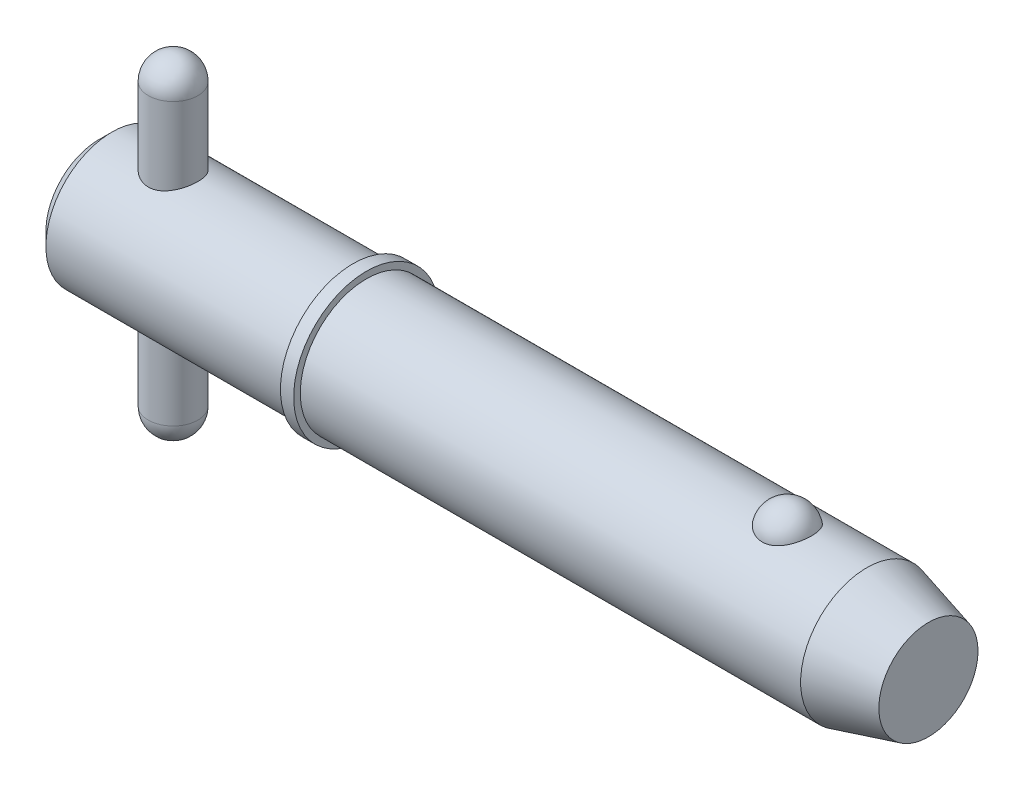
ISO-10303-21;
HEADER;
FILE_DESCRIPTION(('STEP AP214'),'2;1');
FILE_NAME('part.step','',(''),(''),'','','');
FILE_SCHEMA(('AUTOMOTIVE_DESIGN { 1 0 10303 214 1 1 1 1 }'));
ENDSEC;
DATA;
#1=APPLICATION_CONTEXT('core data for automotive mechanical design processes');
#2=APPLICATION_PROTOCOL_DEFINITION('international standard','automotive_design',2000,#1);
#3=PRODUCT_CONTEXT('',#1,'mechanical');
#4=PRODUCT('Part','Part','',(#3));
#5=PRODUCT_RELATED_PRODUCT_CATEGORY('part','',(#4));
#6=PRODUCT_DEFINITION_FORMATION('','',#4);
#7=PRODUCT_DEFINITION_CONTEXT('part definition',#1,'design');
#8=PRODUCT_DEFINITION('design','',#6,#7);
#9=PRODUCT_DEFINITION_SHAPE('','',#8);
#10=(LENGTH_UNIT() NAMED_UNIT(*) SI_UNIT(.MILLI.,.METRE.));
#11=(NAMED_UNIT(*) PLANE_ANGLE_UNIT() SI_UNIT($,.RADIAN.));
#12=(NAMED_UNIT(*) SI_UNIT($,.STERADIAN.) SOLID_ANGLE_UNIT());
#13=UNCERTAINTY_MEASURE_WITH_UNIT(LENGTH_MEASURE(1.E-05),#10,'distance_accuracy_value','');
#14=(GEOMETRIC_REPRESENTATION_CONTEXT(3) GLOBAL_UNCERTAINTY_ASSIGNED_CONTEXT((#13)) GLOBAL_UNIT_ASSIGNED_CONTEXT((#10,
#11,#12)) REPRESENTATION_CONTEXT('',''));
#15=CARTESIAN_POINT('',(0.,0.,0.));
#16=DIRECTION('',(0.,0.,1.));
#17=DIRECTION('',(1.,0.,0.));
#18=AXIS2_PLACEMENT_3D('',#15,#16,#17);
#19=CARTESIAN_POINT('',(7.14,15.875,0.));
#20=DIRECTION('',(0.,-1.,0.));
#21=DIRECTION('',(0.,0.,-1.));
#22=AXIS2_PLACEMENT_3D('',#19,#20,#21);
#23=CYLINDRICAL_SURFACE('',#22,2.38);
#24=CARTESIAN_POINT('',(7.14,-13.495,0.));
#25=DIRECTION('',(0.,-1.,0.));
#26=DIRECTION('',(0.,0.,-1.));
#27=AXIS2_PLACEMENT_3D('',#24,#25,#26);
#28=CIRCLE('',#27,2.38);
#29=CARTESIAN_POINT('',(7.14,-13.495,-2.38));
#30=VERTEX_POINT('',#29);
#31=EDGE_CURVE('P0_E10',#30,#30,#28,.F.);
#32=ORIENTED_EDGE('',*,*,#31,.T.);
#33=EDGE_LOOP('',(#32));
#34=FACE_BOUND('',#33,.T.);
#35=CARTESIAN_POINT('',(7.14,13.495,0.));
#36=DIRECTION('',(0.,-1.,0.));
#37=DIRECTION('',(0.,0.,-1.));
#38=AXIS2_PLACEMENT_3D('',#35,#36,#37);
#39=CIRCLE('',#38,2.38);
#40=CARTESIAN_POINT('',(7.14,13.495,-2.38));
#41=VERTEX_POINT('',#40);
#42=EDGE_CURVE('P0_E21',#41,#41,#39,.T.);
#43=ORIENTED_EDGE('',*,*,#42,.T.);
#44=EDGE_LOOP('',(#43));
#45=FACE_BOUND('',#44,.T.);
#46=ADVANCED_FACE('P0_F14',(#34,#45),#23,.T.);
#47=CARTESIAN_POINT('',(7.14,-13.495,0.));
#48=DIRECTION('',(0.,0.,1.));
#49=DIRECTION('',(1.,0.,0.));
#50=AXIS2_PLACEMENT_3D('',#47,#48,#49);
#51=SPHERICAL_SURFACE('',#50,2.38);
#52=CARTESIAN_POINT('',(7.14,-13.495,0.));
#53=DIRECTION('',(0.,-1.,0.));
#54=DIRECTION('',(0.,0.,-1.));
#55=AXIS2_PLACEMENT_3D('',#52,#53,#54);
#56=SPHERICAL_SURFACE('',#55,2.38);
#57=ORIENTED_EDGE('',*,*,#31,.F.);
#58=EDGE_LOOP('',(#57));
#59=FACE_BOUND('',#58,.T.);
#60=ADVANCED_FACE('P0_F29',(#59),#56,.T.);
#61=CARTESIAN_POINT('',(7.14,13.495,0.));
#62=DIRECTION('',(0.,0.,1.));
#63=DIRECTION('',(1.,0.,0.));
#64=AXIS2_PLACEMENT_3D('',#61,#62,#63);
#65=SPHERICAL_SURFACE('',#64,2.38);
#66=CARTESIAN_POINT('',(7.14,13.495,0.));
#67=DIRECTION('',(0.,-1.,0.));
#68=DIRECTION('',(0.,0.,-1.));
#69=AXIS2_PLACEMENT_3D('',#66,#67,#68);
#70=SPHERICAL_SURFACE('',#69,2.38);
#71=ORIENTED_EDGE('',*,*,#42,.F.);
#72=EDGE_LOOP('',(#71));
#73=FACE_BOUND('',#72,.T.);
#74=ADVANCED_FACE('P0_F16',(#73),#70,.T.);
#75=CLOSED_SHELL('',(#46,#60,#74));
#76=MANIFOLD_SOLID_BREP('P0_B1',#75);
#77=CARTESIAN_POINT('',(0.,0.,0.));
#78=DIRECTION('',(1.,0.,0.));
#79=DIRECTION('',(0.,0.,-1.));
#80=AXIS2_PLACEMENT_3D('',#77,#78,#79);
#81=CYLINDRICAL_SURFACE('',#80,6.35);
#82=CARTESIAN_POINT('',(73.7553693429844,0.,0.));
#83=DIRECTION('',(1.,0.,0.));
#84=DIRECTION('',(0.,0.,-1.));
#85=AXIS2_PLACEMENT_3D('',#82,#83,#84);
#86=CIRCLE('',#85,6.35);
#87=CARTESIAN_POINT('',(73.7553693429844,0.,-6.35));
#88=VERTEX_POINT('',#87);
#89=EDGE_CURVE('P1_E81',#88,#88,#86,.T.);
#90=ORIENTED_EDGE('',*,*,#89,.F.);
#91=EDGE_LOOP('',(#90));
#92=FACE_BOUND('',#91,.T.);
#93=CARTESIAN_POINT('',(25.7,0.,0.));
#94=DIRECTION('',(1.,0.,0.));
#95=DIRECTION('',(0.,0.,-1.));
#96=AXIS2_PLACEMENT_3D('',#93,#94,#95);
#97=CIRCLE('',#96,6.35);
#98=CARTESIAN_POINT('',(25.7,0.,-6.35));
#99=VERTEX_POINT('',#98);
#100=EDGE_CURVE('P1_E85',#99,#99,#97,.T.);
#101=ORIENTED_EDGE('',*,*,#100,.T.);
#102=EDGE_LOOP('',(#101));
#103=FACE_BOUND('',#102,.T.);
#104=CARTESIAN_POINT('',(66.1300214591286,5.87502187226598,2.40969251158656));
#105=CARTESIAN_POINT('',(66.0050305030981,5.87501645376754,2.40969773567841));
#106=CARTESIAN_POINT('',(65.8800806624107,5.87916061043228,2.39967292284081));
#107=CARTESIAN_POINT('',(65.6339091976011,5.89523112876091,2.35991730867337));
#108=CARTESIAN_POINT('',(65.5126863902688,5.90715499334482,2.33019283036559));
#109=CARTESIAN_POINT('',(65.2775170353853,5.9373956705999,2.25201402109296));
#110=CARTESIAN_POINT('',(65.1635602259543,5.95570321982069,2.20358681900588));
#111=CARTESIAN_POINT('',(64.94557352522,5.99672067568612,2.08937987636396));
#112=CARTESIAN_POINT('',(64.8415457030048,6.01943149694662,2.02359652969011));
#113=CARTESIAN_POINT('',(64.6429437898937,6.06760647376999,1.87428969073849));
#114=CARTESIAN_POINT('',(64.5487268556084,6.09313095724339,1.79031110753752));
#115=CARTESIAN_POINT('',(64.3752557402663,6.14375873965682,1.60800178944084));
#116=CARTESIAN_POINT('',(64.2960043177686,6.16886196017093,1.50966841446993));
#117=CARTESIAN_POINT('',(64.1508457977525,6.2172460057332,1.29645884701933));
#118=CARTESIAN_POINT('',(64.0856885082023,6.24039621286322,1.18104158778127));
#119=CARTESIAN_POINT('',(63.9747035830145,6.28117277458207,0.940351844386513));
#120=CARTESIAN_POINT('',(63.9288776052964,6.29879865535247,0.815078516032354));
#121=CARTESIAN_POINT('',(63.8570234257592,6.32692073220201,0.556494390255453));
#122=CARTESIAN_POINT('',(63.831249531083,6.33732517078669,0.423102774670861));
#123=CARTESIAN_POINT('',(63.8009885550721,6.34957673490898,0.153542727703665));
#124=CARTESIAN_POINT('',(63.7965009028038,6.35142408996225,0.017374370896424));
#125=CARTESIAN_POINT('',(63.8088655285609,6.34638925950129,-0.253036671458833));
#126=CARTESIAN_POINT('',(63.8255949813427,6.33955731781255,-0.387285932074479));
#127=CARTESIAN_POINT('',(63.879843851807,6.31794129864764,-0.650851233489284));
#128=CARTESIAN_POINT('',(63.9173636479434,6.30315707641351,-0.7801671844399));
#129=CARTESIAN_POINT('',(64.012500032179,6.26711642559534,-1.03041949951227));
#130=CARTESIAN_POINT('',(64.070143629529,6.24585130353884,-1.1513443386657));
#131=CARTESIAN_POINT('',(64.2043522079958,6.19905619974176,-1.38129800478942));
#132=CARTESIAN_POINT('',(64.2809187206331,6.17352587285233,-1.49032586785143));
#133=CARTESIAN_POINT('',(64.4517538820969,6.12080227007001,-1.69393164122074));
#134=CARTESIAN_POINT('',(64.5461008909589,6.09360200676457,-1.78844209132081));
#135=CARTESIAN_POINT('',(64.7501196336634,6.0407043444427,-1.95970536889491));
#136=CARTESIAN_POINT('',(64.8597900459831,6.01500681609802,-2.03645972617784));
#137=CARTESIAN_POINT('',(65.0891876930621,5.96867714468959,-2.16845644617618));
#138=CARTESIAN_POINT('',(65.2086522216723,5.94794910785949,-2.22412062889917));
#139=CARTESIAN_POINT('',(65.4562188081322,5.91340580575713,-2.31440992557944));
#140=CARTESIAN_POINT('',(65.5843175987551,5.89958794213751,-2.34904294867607));
#141=CARTESIAN_POINT('',(65.838582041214,5.88111049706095,-2.39491590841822));
#142=CARTESIAN_POINT('',(65.9645207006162,5.87602512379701,-2.40724512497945));
#143=CARTESIAN_POINT('',(66.2167867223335,5.87428980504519,-2.41147867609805));
#144=CARTESIAN_POINT('',(66.343114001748,5.87763817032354,-2.40338710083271));
#145=CARTESIAN_POINT('',(66.5884170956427,5.89212921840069,-2.36762715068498));
#146=CARTESIAN_POINT('',(66.7074992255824,5.90302431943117,-2.34058030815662));
#147=CARTESIAN_POINT('',(66.9392447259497,5.93113752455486,-2.2683906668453));
#148=CARTESIAN_POINT('',(67.0519075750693,5.94835614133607,-2.22324640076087));
#149=CARTESIAN_POINT('',(67.2704009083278,5.98773016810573,-2.11493806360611));
#150=CARTESIAN_POINT('',(67.376028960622,6.00998499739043,-2.05140269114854));
#151=CARTESIAN_POINT('',(67.5753006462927,6.0569014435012,-1.90842705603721));
#152=CARTESIAN_POINT('',(67.6689415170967,6.08156361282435,-1.82898313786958));
#153=CARTESIAN_POINT('',(67.8466754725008,6.13211715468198,-1.6518242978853));
#154=CARTESIAN_POINT('',(67.930055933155,6.15800825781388,-1.55339381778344));
#155=CARTESIAN_POINT('',(68.0797900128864,6.20712834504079,-1.34374214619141));
#156=CARTESIAN_POINT('',(68.1461405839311,6.23035685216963,-1.23251867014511));
#157=CARTESIAN_POINT('',(68.2623455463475,6.27251177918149,-0.996447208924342));
#158=CARTESIAN_POINT('',(68.3116072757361,6.29127762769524,-0.8712781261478));
#159=CARTESIAN_POINT('',(68.3896142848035,6.3215862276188,-0.613870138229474));
#160=CARTESIAN_POINT('',(68.4183593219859,6.33312889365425,-0.481631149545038));
#161=CARTESIAN_POINT('',(68.4547705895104,6.34782349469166,-0.213672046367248));
#162=CARTESIAN_POINT('',(68.4624134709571,6.35096613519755,-0.077948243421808));
#163=CARTESIAN_POINT('',(68.4563951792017,6.34851322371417,0.192943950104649));
#164=CARTESIAN_POINT('',(68.4427343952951,6.3429178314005,0.328112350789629));
#165=CARTESIAN_POINT('',(68.3945036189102,6.32360512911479,0.593406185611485));
#166=CARTESIAN_POINT('',(68.3600313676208,6.30992579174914,0.723552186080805));
#167=CARTESIAN_POINT('',(68.2709539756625,6.27586325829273,0.975834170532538));
#168=CARTESIAN_POINT('',(68.2163476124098,6.25547965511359,1.09796966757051));
#169=CARTESIAN_POINT('',(68.0877587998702,6.20998183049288,1.33148921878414));
#170=CARTESIAN_POINT('',(68.0136742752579,6.18484288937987,1.44281227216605));
#171=CARTESIAN_POINT('',(67.8478204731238,6.13258735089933,1.65087683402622));
#172=CARTESIAN_POINT('',(67.7560515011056,6.10547078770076,1.74761859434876));
#173=CARTESIAN_POINT('',(67.5571839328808,6.05235879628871,1.92350926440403));
#174=CARTESIAN_POINT('',(67.450133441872,6.02636017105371,2.00271146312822));
#175=CARTESIAN_POINT('',(67.2231384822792,5.97843747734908,2.14154159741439));
#176=CARTESIAN_POINT('',(67.103191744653,5.95651412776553,2.2011660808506));
#177=CARTESIAN_POINT('',(66.8445236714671,5.91812106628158,2.30250570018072));
#178=CARTESIAN_POINT('',(66.7050698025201,5.90217533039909,2.34256795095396));
#179=CARTESIAN_POINT('',(66.4203974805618,5.88063128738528,2.39615214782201));
#180=CARTESIAN_POINT('',(66.2751817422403,5.87502816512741,2.40968644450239));
#181=CARTESIAN_POINT('',(66.1300214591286,5.87502187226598,2.40969251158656));
#182=B_SPLINE_CURVE_WITH_KNOTS('',3,(#104,#105,#106,#107,#108,#109,#110,#111,#112,#113,#114,
#115,#116,#117,#118,#119,#120,#121,#122,#123,#124,#125,#126,#127,#128,#129,#130,#131,#132,#133,
#134,#135,#136,#137,#138,#139,#140,#141,#142,#143,#144,#145,#146,#147,#148,#149,#150,#151,#152,
#153,#154,#155,#156,#157,#158,#159,#160,#161,#162,#163,#164,#165,#166,#167,#168,#169,#170,#171,
#172,#173,#174,#175,#176,#177,#178,#179,#180,#181),.UNSPECIFIED.,.T.,.F.,(4,2,2,2,2,2,2,2,2,2,2,
2,2,2,2,2,2,2,2,2,2,2,2,2,2,2,2,2,2,2,2,2,2,2,2,2,2,2,4),(0.,0.374440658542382,
0.748761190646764,1.12254078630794,1.49639810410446,1.88098871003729,2.26565013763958,
2.66741104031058,3.0692063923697,3.47601794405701,3.88281858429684,4.28727498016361,
4.69173873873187,5.09674745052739,5.50178895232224,5.90865911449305,6.31549420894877,
6.71369855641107,7.11175305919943,7.48978077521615,7.86773278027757,8.23383886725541,
8.59997464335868,8.97409044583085,9.34829231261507,9.74122667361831,10.1342313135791,
10.539752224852,10.945277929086,11.3512521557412,11.7572189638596,12.1612938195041,
12.5653932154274,12.9716540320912,13.37790783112,13.782909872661,14.1879832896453,
14.6230486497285,15.0579114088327),.UNSPECIFIED.);
#183=CARTESIAN_POINT('',(66.1300214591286,5.87502187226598,2.40969251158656));
#184=VERTEX_POINT('',#183);
#185=EDGE_CURVE('P1_E35',#184,#184,#182,.T.);
#186=ORIENTED_EDGE('',*,*,#185,.T.);
#187=EDGE_LOOP('',(#186));
#188=FACE_BOUND('',#187,.T.);
#189=ADVANCED_FACE('P1_F13',(#92,#103,#188),#81,.T.);
#190=CARTESIAN_POINT('',(0.,0.,0.));
#191=DIRECTION('',(-1.,0.,0.));
#192=DIRECTION('',(0.,0.,1.));
#193=AXIS2_PLACEMENT_3D('',#190,#191,#192);
#194=PLANE('',#193);
#195=CARTESIAN_POINT('',(0.,0.,0.));
#196=DIRECTION('',(1.,0.,0.));
#197=DIRECTION('',(0.,0.,-1.));
#198=AXIS2_PLACEMENT_3D('',#195,#196,#197);
#199=CIRCLE('',#198,5.08);
#200=CARTESIAN_POINT('',(0.,0.,-5.08));
#201=VERTEX_POINT('',#200);
#202=EDGE_CURVE('P1_E9',#201,#201,#199,.T.);
#203=ORIENTED_EDGE('',*,*,#202,.F.);
#204=EDGE_LOOP('',(#203));
#205=FACE_BOUND('',#204,.T.);
#206=ADVANCED_FACE('P1_F15',(#205),#194,.T.);
#207=CARTESIAN_POINT('',(1.27,0.,0.));
#208=DIRECTION('',(1.,0.,0.));
#209=DIRECTION('',(0.,0.,-1.));
#210=AXIS2_PLACEMENT_3D('',#207,#208,#209);
#211=CONICAL_SURFACE('',#210,6.35,0.78539816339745);
#212=ORIENTED_EDGE('',*,*,#202,.T.);
#213=EDGE_LOOP('',(#212));
#214=FACE_BOUND('',#213,.T.);
#215=CARTESIAN_POINT('',(1.27,0.,0.));
#216=DIRECTION('',(1.,0.,0.));
#217=DIRECTION('',(0.,0.,-1.));
#218=AXIS2_PLACEMENT_3D('',#215,#216,#217);
#219=CIRCLE('',#218,6.35);
#220=CARTESIAN_POINT('',(1.27,0.,-6.35));
#221=VERTEX_POINT('',#220);
#222=EDGE_CURVE('P1_E26',#221,#221,#219,.T.);
#223=ORIENTED_EDGE('',*,*,#222,.F.);
#224=EDGE_LOOP('',(#223));
#225=FACE_BOUND('',#224,.T.);
#226=ADVANCED_FACE('P1_F77',(#214,#225),#211,.T.);
#227=CARTESIAN_POINT('',(0.,0.,0.));
#228=DIRECTION('',(1.,0.,0.));
#229=DIRECTION('',(0.,0.,-1.));
#230=AXIS2_PLACEMENT_3D('',#227,#228,#229);
#231=CYLINDRICAL_SURFACE('',#230,6.35);
#232=CARTESIAN_POINT('',(7.14,-5.88711304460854,2.38));
#233=CARTESIAN_POINT('',(7.01146258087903,-5.88710856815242,2.38000480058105));
#234=CARTESIAN_POINT('',(6.88295682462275,-5.89136840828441,2.36955244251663));
#235=CARTESIAN_POINT('',(6.62981934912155,-5.90782785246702,2.32820953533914));
#236=CARTESIAN_POINT('',(6.50518751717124,-5.92002722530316,2.29731958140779));
#237=CARTESIAN_POINT('',(6.26352403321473,-5.95079384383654,2.21639366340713));
#238=CARTESIAN_POINT('',(6.14647496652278,-5.96934583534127,2.16640353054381));
#239=CARTESIAN_POINT('',(5.92237941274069,-6.01070278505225,2.04885862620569));
#240=CARTESIAN_POINT('',(5.81533593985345,-6.03350901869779,1.98129858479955));
#241=CARTESIAN_POINT('',(5.60897525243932,-6.08207341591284,1.82693902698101));
#242=CARTESIAN_POINT('',(5.51022503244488,-6.10791836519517,1.73940861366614));
#243=CARTESIAN_POINT('',(5.32840561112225,-6.15892405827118,1.54914379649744));
#244=CARTESIAN_POINT('',(5.24533975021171,-6.1840846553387,1.44640616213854));
#245=CARTESIAN_POINT('',(5.09451639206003,-6.23191821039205,1.22434014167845));
#246=CARTESIAN_POINT('',(5.02737511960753,-6.25447755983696,1.10456656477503));
#247=CARTESIAN_POINT('',(4.91443001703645,-6.2935236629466,0.854429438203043));
#248=CARTESIAN_POINT('',(4.86861879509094,-6.31001251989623,0.724069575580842));
#249=CARTESIAN_POINT('',(4.80162253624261,-6.33444370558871,0.46242122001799));
#250=CARTESIAN_POINT('',(4.77946137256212,-6.34272370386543,0.331414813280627));
#251=CARTESIAN_POINT('',(4.75726677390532,-6.35101600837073,0.0672982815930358));
#252=CARTESIAN_POINT('',(4.75722615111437,-6.35103100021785,-0.0658111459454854));
#253=CARTESIAN_POINT('',(4.77870510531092,-6.3430064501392,-0.323358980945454));
#254=CARTESIAN_POINT('',(4.79915922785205,-6.33536494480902,-0.447900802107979));
#255=CARTESIAN_POINT('',(4.85925493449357,-6.31340794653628,-0.69163609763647));
#256=CARTESIAN_POINT('',(4.89889787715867,-6.29909198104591,-0.810829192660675));
#257=CARTESIAN_POINT('',(4.9967414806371,-6.26494471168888,-1.04254212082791));
#258=CARTESIAN_POINT('',(5.05520370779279,-6.24503620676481,-1.1549396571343));
#259=CARTESIAN_POINT('',(5.1887948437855,-6.20171869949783,-1.3686079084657));
#260=CARTESIAN_POINT('',(5.26392912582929,-6.17830856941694,-1.46987502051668));
#261=CARTESIAN_POINT('',(5.43386591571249,-6.12878580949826,-1.66468415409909));
#262=CARTESIAN_POINT('',(5.52956139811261,-6.10259519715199,-1.75742857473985));
#263=CARTESIAN_POINT('',(5.73530435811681,-6.05155777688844,-1.92585331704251));
#264=CARTESIAN_POINT('',(5.84535542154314,-6.02671130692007,-2.00152936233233));
#265=CARTESIAN_POINT('',(6.07982989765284,-5.98068420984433,-2.13519109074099));
#266=CARTESIAN_POINT('',(6.20451768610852,-5.95959698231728,-2.19274775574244));
#267=CARTESIAN_POINT('',(6.4628145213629,-5.92455622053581,-2.28574558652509));
#268=CARTESIAN_POINT('',(6.59641856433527,-5.91059872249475,-2.32119904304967));
#269=CARTESIAN_POINT('',(6.86087441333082,-5.8923327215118,-2.36717069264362));
#270=CARTESIAN_POINT('',(6.99147192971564,-5.8875347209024,-2.37895573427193));
#271=CARTESIAN_POINT('',(7.25283805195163,-5.88674545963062,-2.38091046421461));
#272=CARTESIAN_POINT('',(7.38360660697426,-5.89075200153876,-2.37108554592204));
#273=CARTESIAN_POINT('',(7.63510696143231,-5.90662331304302,-2.33124781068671));
#274=CARTESIAN_POINT('',(7.75602069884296,-5.91810660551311,-2.30221396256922));
#275=CARTESIAN_POINT('',(7.99120505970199,-5.94718527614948,-2.22601401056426));
#276=CARTESIAN_POINT('',(8.10547431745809,-5.96478190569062,-2.17884419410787));
#277=CARTESIAN_POINT('',(8.32888632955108,-6.00491533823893,-2.06572311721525));
#278=CARTESIAN_POINT('',(8.43767672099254,-6.02761250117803,-1.99913452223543));
#279=CARTESIAN_POINT('',(8.6429894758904,-6.07511988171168,-1.84974438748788));
#280=CARTESIAN_POINT('',(8.73950733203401,-6.09993087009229,-1.76693691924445));
#281=CARTESIAN_POINT('',(8.9238741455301,-6.1507686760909,-1.58125563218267));
#282=CARTESIAN_POINT('',(9.01078732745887,-6.17677301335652,-1.47744327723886));
#283=CARTESIAN_POINT('',(9.16607127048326,-6.22556172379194,-1.25606967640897));
#284=CARTESIAN_POINT('',(9.23444197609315,-6.24834608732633,-1.13850838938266));
#285=CARTESIAN_POINT('',(9.3502493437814,-6.28811144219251,-0.893050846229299));
#286=CARTESIAN_POINT('',(9.39775808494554,-6.30511236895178,-0.765192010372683));
#287=CARTESIAN_POINT('',(9.47032640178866,-6.33145833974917,-0.502514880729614));
#288=CARTESIAN_POINT('',(9.49539651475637,-6.34080697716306,-0.367699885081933));
#289=CARTESIAN_POINT('',(9.52124059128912,-6.35045496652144,-0.103396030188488));
#290=CARTESIAN_POINT('',(9.52334421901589,-6.35124952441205,0.025945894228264));
#291=CARTESIAN_POINT('',(9.50661518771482,-6.34499064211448,0.283061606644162));
#292=CARTESIAN_POINT('',(9.48778504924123,-6.33793814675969,0.410835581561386));
#293=CARTESIAN_POINT('',(9.43065630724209,-6.31700307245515,0.658028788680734));
#294=CARTESIAN_POINT('',(9.39284291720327,-6.30329098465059,0.7775756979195));
#295=CARTESIAN_POINT('',(9.29930406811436,-6.27046903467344,1.00863789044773));
#296=CARTESIAN_POINT('',(9.2435752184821,-6.25135815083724,1.12015164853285));
#297=CARTESIAN_POINT('',(9.11312349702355,-6.20865254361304,1.33711407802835));
#298=CARTESIAN_POINT('',(9.03770094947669,-6.18490316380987,1.44211105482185));
#299=CARTESIAN_POINT('',(8.87110640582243,-6.13583718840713,1.63836897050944));
#300=CARTESIAN_POINT('',(8.77992879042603,-6.11052003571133,1.72962498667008));
#301=CARTESIAN_POINT('',(8.57869799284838,-6.05953829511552,1.90076098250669));
#302=CARTESIAN_POINT('',(8.46790320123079,-6.03392573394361,1.97978778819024));
#303=CARTESIAN_POINT('',(8.23379693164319,-5.98676607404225,2.11813466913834));
#304=CARTESIAN_POINT('',(8.11048418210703,-5.9652193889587,2.17745273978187));
#305=CARTESIAN_POINT('',(7.84900037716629,-5.92818393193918,2.27641807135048));
#306=CARTESIAN_POINT('',(7.71041678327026,-5.91299857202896,2.31510015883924));
#307=CARTESIAN_POINT('',(7.42787316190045,-5.89246887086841,2.36688002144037));
#308=CARTESIAN_POINT('',(7.28391673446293,-5.88711805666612,2.37999462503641));
#309=CARTESIAN_POINT('',(7.14,-5.88711304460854,2.38));
#310=B_SPLINE_CURVE_WITH_KNOTS('',3,(#232,#233,#234,#235,#236,#237,#238,#239,#240,#241,#242,
#243,#244,#245,#246,#247,#248,#249,#250,#251,#252,#253,#254,#255,#256,#257,#258,#259,#260,#261,
#262,#263,#264,#265,#266,#267,#268,#269,#270,#271,#272,#273,#274,#275,#276,#277,#278,#279,#280,
#281,#282,#283,#284,#285,#286,#287,#288,#289,#290,#291,#292,#293,#294,#295,#296,#297,#298,#299,
#300,#301,#302,#303,#304,#305,#306,#307,#308,#309),.UNSPECIFIED.,.T.,.F.,(4,2,2,2,2,2,2,2,2,2,2,
2,2,2,2,2,2,2,2,2,2,2,2,2,2,2,2,2,2,2,2,2,2,2,2,2,2,2,4),(0.,0.385076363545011,
0.770141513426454,1.15428843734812,1.53855071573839,1.94016118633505,2.3418570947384,
2.75720522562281,3.1724093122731,3.569721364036,3.96690431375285,4.34445758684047,
4.72203759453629,5.10511017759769,5.48830640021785,5.89390240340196,6.29959991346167,
6.71428455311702,7.12873839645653,7.52034494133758,7.91185376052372,8.28480528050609,
8.65783318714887,9.0448340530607,9.43197664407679,9.84363087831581,10.2552863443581,
10.6655081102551,11.0755371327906,11.4616919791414,11.847800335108,12.224507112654,
12.6012852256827,12.9938941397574,13.386643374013,13.8000944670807,14.2135876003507,
14.6450218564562,15.0761720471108),.UNSPECIFIED.);
#311=CARTESIAN_POINT('',(7.14,-5.88711304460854,2.38));
#312=VERTEX_POINT('',#311);
#313=EDGE_CURVE('P1_E17',#312,#312,#310,.T.);
#314=ORIENTED_EDGE('',*,*,#313,.F.);
#315=EDGE_LOOP('',(#314));
#316=FACE_BOUND('',#315,.T.);
#317=CARTESIAN_POINT('',(7.14,5.88711304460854,2.38));
#318=CARTESIAN_POINT('',(7.26853741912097,5.88710856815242,2.38000480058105));
#319=CARTESIAN_POINT('',(7.39704317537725,5.89136840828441,2.36955244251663));
#320=CARTESIAN_POINT('',(7.65018065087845,5.90782785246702,2.32820953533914));
#321=CARTESIAN_POINT('',(7.77481248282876,5.92002722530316,2.29731958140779));
#322=CARTESIAN_POINT('',(8.01647596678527,5.95079384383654,2.21639366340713));
#323=CARTESIAN_POINT('',(8.13352503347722,5.96934583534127,2.16640353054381));
#324=CARTESIAN_POINT('',(8.35762058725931,6.01070278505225,2.04885862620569));
#325=CARTESIAN_POINT('',(8.46466406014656,6.03350901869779,1.98129858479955));
#326=CARTESIAN_POINT('',(8.67102474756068,6.08207341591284,1.82693902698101));
#327=CARTESIAN_POINT('',(8.76977496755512,6.10791836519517,1.73940861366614));
#328=CARTESIAN_POINT('',(8.95159438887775,6.15892405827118,1.54914379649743));
#329=CARTESIAN_POINT('',(9.03466024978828,6.1840846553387,1.44640616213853));
#330=CARTESIAN_POINT('',(9.18548360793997,6.23191821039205,1.22434014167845));
#331=CARTESIAN_POINT('',(9.25262488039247,6.25447755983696,1.10456656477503));
#332=CARTESIAN_POINT('',(9.36556998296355,6.2935236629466,0.854429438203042));
#333=CARTESIAN_POINT('',(9.41138120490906,6.31001251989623,0.72406957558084));
#334=CARTESIAN_POINT('',(9.47837746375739,6.33444370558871,0.462421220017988));
#335=CARTESIAN_POINT('',(9.50053862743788,6.34272370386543,0.331414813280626));
#336=CARTESIAN_POINT('',(9.52273322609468,6.35101600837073,0.0672982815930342));
#337=CARTESIAN_POINT('',(9.52277384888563,6.35103100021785,-0.0658111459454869));
#338=CARTESIAN_POINT('',(9.50129489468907,6.3430064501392,-0.323358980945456));
#339=CARTESIAN_POINT('',(9.48084077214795,6.33536494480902,-0.447900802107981));
#340=CARTESIAN_POINT('',(9.42074506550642,6.31340794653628,-0.691636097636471));
#341=CARTESIAN_POINT('',(9.38110212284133,6.29909198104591,-0.810829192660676));
#342=CARTESIAN_POINT('',(9.2832585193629,6.26494471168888,-1.04254212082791));
#343=CARTESIAN_POINT('',(9.22479629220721,6.24503620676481,-1.1549396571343));
#344=CARTESIAN_POINT('',(9.0912051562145,6.20171869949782,-1.3686079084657));
#345=CARTESIAN_POINT('',(9.0160708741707,6.17830856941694,-1.46987502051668));
#346=CARTESIAN_POINT('',(8.84613408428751,6.12878580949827,-1.66468415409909));
#347=CARTESIAN_POINT('',(8.75043860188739,6.10259519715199,-1.75742857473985));
#348=CARTESIAN_POINT('',(8.54469564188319,6.05155777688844,-1.92585331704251));
#349=CARTESIAN_POINT('',(8.43464457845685,6.02671130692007,-2.00152936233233));
#350=CARTESIAN_POINT('',(8.20017010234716,5.98068420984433,-2.13519109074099));
#351=CARTESIAN_POINT('',(8.07548231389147,5.95959698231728,-2.19274775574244));
#352=CARTESIAN_POINT('',(7.8171854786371,5.9245562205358,-2.28574558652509));
#353=CARTESIAN_POINT('',(7.68358143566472,5.91059872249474,-2.32119904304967));
#354=CARTESIAN_POINT('',(7.41912558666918,5.8923327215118,-2.36717069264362));
#355=CARTESIAN_POINT('',(7.28852807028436,5.8875347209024,-2.37895573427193));
#356=CARTESIAN_POINT('',(7.02716194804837,5.88674545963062,-2.38091046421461));
#357=CARTESIAN_POINT('',(6.89639339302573,5.89075200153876,-2.37108554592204));
#358=CARTESIAN_POINT('',(6.64489303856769,5.90662331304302,-2.33124781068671));
#359=CARTESIAN_POINT('',(6.52397930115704,5.91810660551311,-2.30221396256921));
#360=CARTESIAN_POINT('',(6.288794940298,5.94718527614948,-2.22601401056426));
#361=CARTESIAN_POINT('',(6.17452568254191,5.96478190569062,-2.17884419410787));
#362=CARTESIAN_POINT('',(5.95111367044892,6.00491533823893,-2.06572311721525));
#363=CARTESIAN_POINT('',(5.84232327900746,6.02761250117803,-1.99913452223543));
#364=CARTESIAN_POINT('',(5.6370105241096,6.07511988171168,-1.84974438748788));
#365=CARTESIAN_POINT('',(5.54049266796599,6.09993087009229,-1.76693691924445));
#366=CARTESIAN_POINT('',(5.3561258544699,6.1507686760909,-1.58125563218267));
#367=CARTESIAN_POINT('',(5.26921267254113,6.17677301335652,-1.47744327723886));
#368=CARTESIAN_POINT('',(5.11392872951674,6.22556172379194,-1.25606967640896));
#369=CARTESIAN_POINT('',(5.04555802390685,6.24834608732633,-1.13850838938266));
#370=CARTESIAN_POINT('',(4.9297506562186,6.28811144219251,-0.893050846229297));
#371=CARTESIAN_POINT('',(4.88224191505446,6.30511236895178,-0.76519201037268));
#372=CARTESIAN_POINT('',(4.80967359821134,6.33145833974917,-0.502514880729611));
#373=CARTESIAN_POINT('',(4.78460348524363,6.34080697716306,-0.36769988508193));
#374=CARTESIAN_POINT('',(4.75875940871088,6.35045496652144,-0.103396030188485));
#375=CARTESIAN_POINT('',(4.75665578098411,6.35124952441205,0.025945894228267));
#376=CARTESIAN_POINT('',(4.77338481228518,6.34499064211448,0.283061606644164));
#377=CARTESIAN_POINT('',(4.79221495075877,6.33793814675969,0.410835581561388));
#378=CARTESIAN_POINT('',(4.84934369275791,6.31700307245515,0.658028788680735));
#379=CARTESIAN_POINT('',(4.88715708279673,6.30329098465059,0.777575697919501));
#380=CARTESIAN_POINT('',(4.98069593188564,6.27046903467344,1.00863789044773));
#381=CARTESIAN_POINT('',(5.0364247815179,6.25135815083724,1.12015164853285));
#382=CARTESIAN_POINT('',(5.16687650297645,6.20865254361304,1.33711407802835));
#383=CARTESIAN_POINT('',(5.24229905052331,6.18490316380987,1.44211105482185));
#384=CARTESIAN_POINT('',(5.40889359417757,6.13583718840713,1.63836897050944));
#385=CARTESIAN_POINT('',(5.50007120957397,6.11052003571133,1.72962498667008));
#386=CARTESIAN_POINT('',(5.70130200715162,6.05953829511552,1.90076098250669));
#387=CARTESIAN_POINT('',(5.81209679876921,6.03392573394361,1.97978778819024));
#388=CARTESIAN_POINT('',(6.04620306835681,5.98676607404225,2.11813466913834));
#389=CARTESIAN_POINT('',(6.16951581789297,5.9652193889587,2.17745273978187));
#390=CARTESIAN_POINT('',(6.43099962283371,5.92818393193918,2.27641807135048));
#391=CARTESIAN_POINT('',(6.56958321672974,5.91299857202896,2.31510015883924));
#392=CARTESIAN_POINT('',(6.85212683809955,5.89246887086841,2.36688002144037));
#393=CARTESIAN_POINT('',(6.99608326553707,5.88711805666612,2.37999462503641));
#394=CARTESIAN_POINT('',(7.14,5.88711304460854,2.38));
#395=B_SPLINE_CURVE_WITH_KNOTS('',3,(#317,#318,#319,#320,#321,#322,#323,#324,#325,#326,#327,
#328,#329,#330,#331,#332,#333,#334,#335,#336,#337,#338,#339,#340,#341,#342,#343,#344,#345,#346,
#347,#348,#349,#350,#351,#352,#353,#354,#355,#356,#357,#358,#359,#360,#361,#362,#363,#364,#365,
#366,#367,#368,#369,#370,#371,#372,#373,#374,#375,#376,#377,#378,#379,#380,#381,#382,#383,#384,
#385,#386,#387,#388,#389,#390,#391,#392,#393,#394),.UNSPECIFIED.,.T.,.F.,(4,2,2,2,2,2,2,2,2,2,2,
2,2,2,2,2,2,2,2,2,2,2,2,2,2,2,2,2,2,2,2,2,2,2,2,2,2,2,4),(0.,0.385076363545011,
0.770141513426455,1.15428843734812,1.53855071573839,1.94016118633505,2.3418570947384,
2.75720522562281,3.1724093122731,3.56972136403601,3.96690431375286,4.34445758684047,
4.72203759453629,5.10511017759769,5.48830640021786,5.89390240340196,6.29959991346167,
6.71428455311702,7.12873839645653,7.52034494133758,7.91185376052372,8.2848052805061,
8.65783318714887,9.0448340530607,9.43197664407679,9.84363087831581,10.2552863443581,
10.6655081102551,11.0755371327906,11.4616919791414,11.847800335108,12.2245071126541,
12.6012852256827,12.9938941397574,13.386643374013,13.8000944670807,14.2135876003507,
14.6450218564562,15.0761720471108),.UNSPECIFIED.);
#396=CARTESIAN_POINT('',(7.14,5.88711304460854,2.38));
#397=VERTEX_POINT('',#396);
#398=EDGE_CURVE('P1_E43',#397,#397,#395,.T.);
#399=ORIENTED_EDGE('',*,*,#398,.F.);
#400=EDGE_LOOP('',(#399));
#401=FACE_BOUND('',#400,.T.);
#402=ORIENTED_EDGE('',*,*,#222,.T.);
#403=EDGE_LOOP('',(#402));
#404=FACE_BOUND('',#403,.T.);
#405=CARTESIAN_POINT('',(24.43,0.,0.));
#406=DIRECTION('',(1.,0.,0.));
#407=DIRECTION('',(0.,0.,-1.));
#408=AXIS2_PLACEMENT_3D('',#405,#406,#407);
#409=CIRCLE('',#408,6.35);
#410=CARTESIAN_POINT('',(24.43,0.,-6.35));
#411=VERTEX_POINT('',#410);
#412=EDGE_CURVE('P1_E31',#411,#411,#409,.T.);
#413=ORIENTED_EDGE('',*,*,#412,.F.);
#414=EDGE_LOOP('',(#413));
#415=FACE_BOUND('',#414,.T.);
#416=ADVANCED_FACE('P1_F103',(#316,#401,#404,#415),#231,.T.);
#417=CARTESIAN_POINT('',(24.43,6.35,0.));
#418=DIRECTION('',(-1.,0.,0.));
#419=DIRECTION('',(0.,0.,1.));
#420=AXIS2_PLACEMENT_3D('',#417,#418,#419);
#421=PLANE('',#420);
#422=ORIENTED_EDGE('',*,*,#412,.T.);
#423=EDGE_LOOP('',(#422));
#424=FACE_BOUND('',#423,.T.);
#425=CARTESIAN_POINT('',(24.43,0.,0.));
#426=DIRECTION('',(1.,0.,0.));
#427=DIRECTION('',(0.,0.,-1.));
#428=AXIS2_PLACEMENT_3D('',#425,#426,#427);
#429=CIRCLE('',#428,6.985);
#430=CARTESIAN_POINT('',(24.43,0.,-6.985));
#431=VERTEX_POINT('',#430);
#432=EDGE_CURVE('P1_E91',#431,#431,#429,.T.);
#433=ORIENTED_EDGE('',*,*,#432,.F.);
#434=EDGE_LOOP('',(#433));
#435=FACE_BOUND('',#434,.T.);
#436=ADVANCED_FACE('P1_F100',(#424,#435),#421,.T.);
#437=CARTESIAN_POINT('',(0.,0.,0.));
#438=DIRECTION('',(1.,0.,0.));
#439=DIRECTION('',(0.,0.,-1.));
#440=AXIS2_PLACEMENT_3D('',#437,#438,#439);
#441=CYLINDRICAL_SURFACE('',#440,6.985);
#442=ORIENTED_EDGE('',*,*,#432,.T.);
#443=EDGE_LOOP('',(#442));
#444=FACE_BOUND('',#443,.T.);
#445=CARTESIAN_POINT('',(25.7,0.,0.));
#446=DIRECTION('',(1.,0.,0.));
#447=DIRECTION('',(0.,0.,-1.));
#448=AXIS2_PLACEMENT_3D('',#445,#446,#447);
#449=CIRCLE('',#448,6.985);
#450=CARTESIAN_POINT('',(25.7,0.,-6.985));
#451=VERTEX_POINT('',#450);
#452=EDGE_CURVE('P1_E88',#451,#451,#449,.T.);
#453=ORIENTED_EDGE('',*,*,#452,.F.);
#454=EDGE_LOOP('',(#453));
#455=FACE_BOUND('',#454,.T.);
#456=ADVANCED_FACE('P1_F68',(#444,#455),#441,.T.);
#457=CARTESIAN_POINT('',(25.7,6.985,0.));
#458=DIRECTION('',(1.,0.,0.));
#459=DIRECTION('',(0.,0.,-1.));
#460=AXIS2_PLACEMENT_3D('',#457,#458,#459);
#461=PLANE('',#460);
#462=ORIENTED_EDGE('',*,*,#452,.T.);
#463=EDGE_LOOP('',(#462));
#464=FACE_BOUND('',#463,.T.);
#465=ORIENTED_EDGE('',*,*,#100,.F.);
#466=EDGE_LOOP('',(#465));
#467=FACE_BOUND('',#466,.T.);
#468=ADVANCED_FACE('P1_F62',(#464,#467),#461,.T.);
#469=CARTESIAN_POINT('',(79.68,0.,0.));
#470=DIRECTION('',(-1.,0.,0.));
#471=DIRECTION('',(0.,0.,1.));
#472=AXIS2_PLACEMENT_3D('',#469,#470,#471);
#473=CONICAL_SURFACE('',#472,4.76250000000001,0.26179938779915);
#474=ORIENTED_EDGE('',*,*,#89,.T.);
#475=EDGE_LOOP('',(#474));
#476=FACE_BOUND('',#475,.T.);
#477=CARTESIAN_POINT('',(79.68,0.,0.));
#478=DIRECTION('',(1.,0.,0.));
#479=DIRECTION('',(0.,0.,-1.));
#480=AXIS2_PLACEMENT_3D('',#477,#478,#479);
#481=CIRCLE('',#480,4.76250000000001);
#482=CARTESIAN_POINT('',(79.68,0.,-4.76250000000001));
#483=VERTEX_POINT('',#482);
#484=EDGE_CURVE('P1_E42',#483,#483,#481,.T.);
#485=ORIENTED_EDGE('',*,*,#484,.F.);
#486=EDGE_LOOP('',(#485));
#487=FACE_BOUND('',#486,.T.);
#488=ADVANCED_FACE('P1_F59',(#476,#487),#473,.T.);
#489=CARTESIAN_POINT('',(79.68,4.76250000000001,0.));
#490=DIRECTION('',(1.,0.,0.));
#491=DIRECTION('',(0.,0.,-1.));
#492=AXIS2_PLACEMENT_3D('',#489,#490,#491);
#493=PLANE('',#492);
#494=ORIENTED_EDGE('',*,*,#484,.T.);
#495=EDGE_LOOP('',(#494));
#496=FACE_BOUND('',#495,.T.);
#497=ADVANCED_FACE('P1_F55',(#496),#493,.T.);
#498=CARTESIAN_POINT('',(66.1300214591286,5.715,0.));
#499=DIRECTION('',(-1.,0.,0.));
#500=DIRECTION('',(0.,1.,0.));
#501=AXIS2_PLACEMENT_3D('',#498,#499,#500);
#502=SPHERICAL_SURFACE('',#501,2.41499999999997);
#503=ORIENTED_EDGE('',*,*,#185,.F.);
#504=EDGE_LOOP('',(#503));
#505=FACE_BOUND('',#504,.T.);
#506=ADVANCED_FACE('P1_F50',(#505),#502,.T.);
#507=CARTESIAN_POINT('',(7.14,-6.985,0.));
#508=DIRECTION('',(0.,1.,0.));
#509=DIRECTION('',(0.,0.,1.));
#510=AXIS2_PLACEMENT_3D('',#507,#508,#509);
#511=CYLINDRICAL_SURFACE('',#510,2.38);
#512=ORIENTED_EDGE('',*,*,#313,.T.);
#513=EDGE_LOOP('',(#512));
#514=FACE_BOUND('',#513,.T.);
#515=ORIENTED_EDGE('',*,*,#398,.T.);
#516=EDGE_LOOP('',(#515));
#517=FACE_BOUND('',#516,.T.);
#518=ADVANCED_FACE('P1_F54',(#514,#517),#511,.F.);
#519=CLOSED_SHELL('',(#189,#206,#226,#416,#436,#456,#468,#488,#497,#506,#518));
#520=MANIFOLD_SOLID_BREP('P1_B1',#519);
#521=ADVANCED_BREP_SHAPE_REPRESENTATION('',(#18,#76,#520),#14);
#522=SHAPE_DEFINITION_REPRESENTATION(#9,#521);
ENDSEC;
END-ISO-10303-21;
